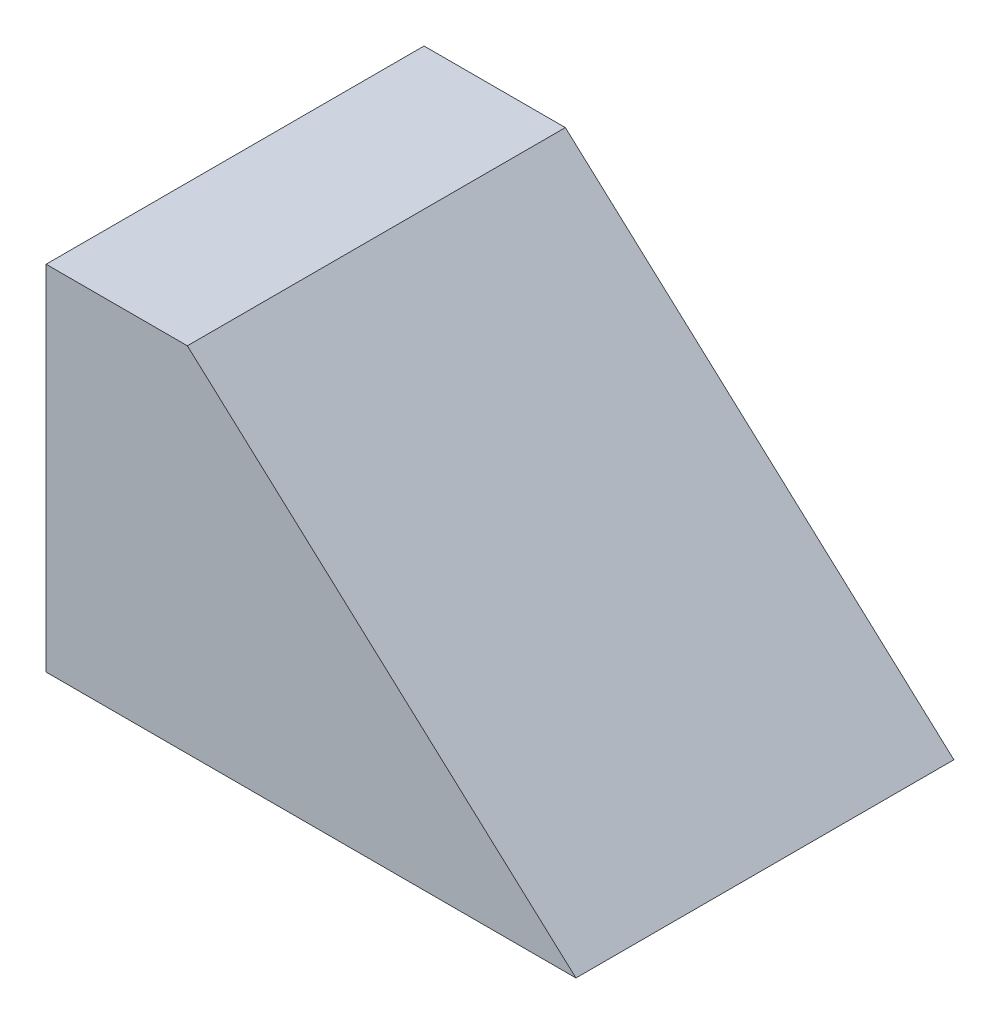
from build123d import *

# Parameters (mm, degrees)
BOSS_EXTRUDE1_DEPTH = 107


with BuildPart() as part:
    # Sketch1 → Boss-Extrude1 (new body)
    with BuildSketch(Plane.XY):
        Polygon((40, 100), (150, 0), (0, 0), (0, 100), align=None)
    extrude(amount=BOSS_EXTRUDE1_DEPTH)


solid = part.part
